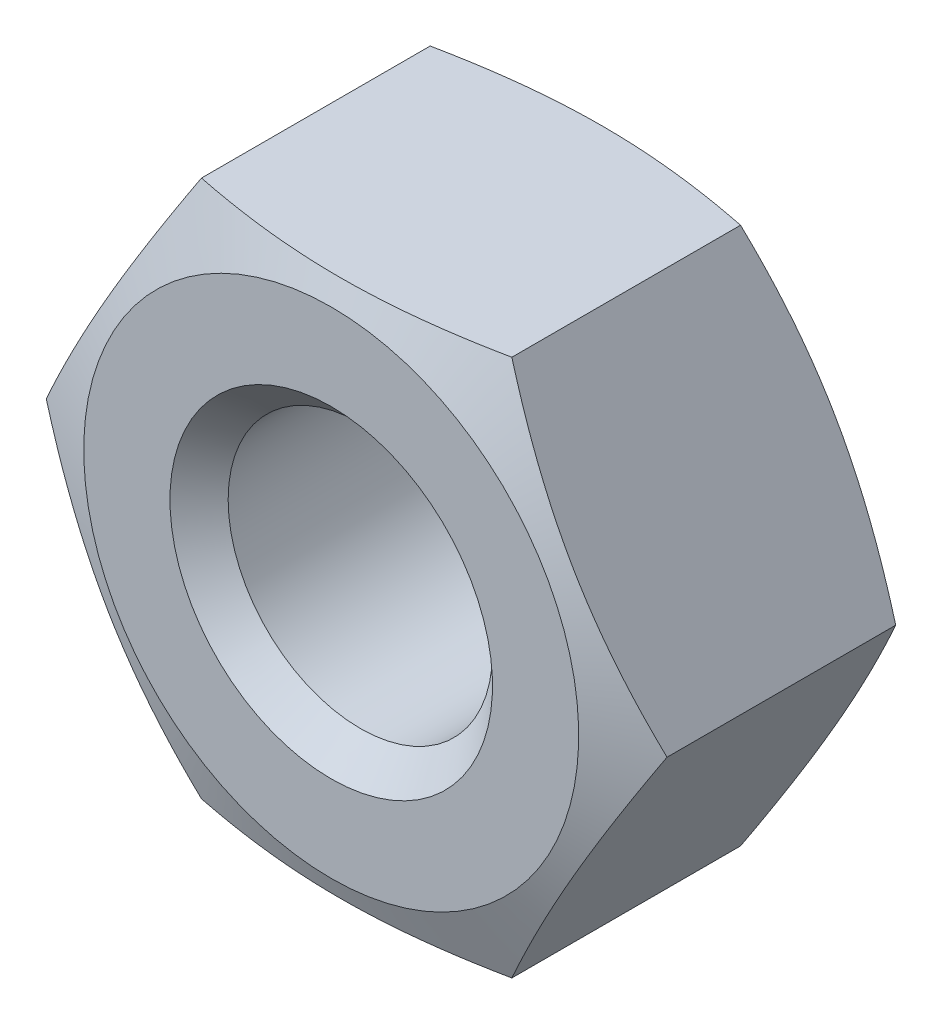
ISO-10303-21;
HEADER;
FILE_DESCRIPTION(('STEP AP214'),'2;1');
FILE_NAME('part.step','',(''),(''),'','','');
FILE_SCHEMA(('AUTOMOTIVE_DESIGN { 1 0 10303 214 1 1 1 1 }'));
ENDSEC;
DATA;
#1=APPLICATION_CONTEXT('core data for automotive mechanical design processes');
#2=APPLICATION_PROTOCOL_DEFINITION('international standard','automotive_design',2000,#1);
#3=PRODUCT_CONTEXT('',#1,'mechanical');
#4=PRODUCT('Part','Part','',(#3));
#5=PRODUCT_RELATED_PRODUCT_CATEGORY('part','',(#4));
#6=PRODUCT_DEFINITION_FORMATION('','',#4);
#7=PRODUCT_DEFINITION_CONTEXT('part definition',#1,'design');
#8=PRODUCT_DEFINITION('design','',#6,#7);
#9=PRODUCT_DEFINITION_SHAPE('','',#8);
#10=(LENGTH_UNIT() NAMED_UNIT(*) SI_UNIT(.MILLI.,.METRE.));
#11=(NAMED_UNIT(*) PLANE_ANGLE_UNIT() SI_UNIT($,.RADIAN.));
#12=(NAMED_UNIT(*) SI_UNIT($,.STERADIAN.) SOLID_ANGLE_UNIT());
#13=UNCERTAINTY_MEASURE_WITH_UNIT(LENGTH_MEASURE(1.E-05),#10,'distance_accuracy_value','');
#14=(GEOMETRIC_REPRESENTATION_CONTEXT(3) GLOBAL_UNCERTAINTY_ASSIGNED_CONTEXT((#13)) GLOBAL_UNIT_ASSIGNED_CONTEXT((#10,
#11,#12)) REPRESENTATION_CONTEXT('',''));
#15=CARTESIAN_POINT('',(0.,0.,0.));
#16=DIRECTION('',(0.,0.,1.));
#17=DIRECTION('',(1.,0.,0.));
#18=AXIS2_PLACEMENT_3D('',#15,#16,#17);
#19=CARTESIAN_POINT('',(5.7735,0.,5.2));
#20=DIRECTION('',(0.,0.,1.));
#21=DIRECTION('',(1.,0.,0.));
#22=AXIS2_PLACEMENT_3D('',#19,#20,#21);
#23=PLANE('',#22);
#24=CARTESIAN_POINT('',(0.,0.,5.2));
#25=DIRECTION('',(0.,0.,-1.));
#26=DIRECTION('',(0.,1.,0.));
#27=AXIS2_PLACEMENT_3D('',#24,#25,#26);
#28=CIRCLE('',#27,3.);
#29=CARTESIAN_POINT('',(0.,3.,5.2));
#30=VERTEX_POINT('',#29);
#31=EDGE_CURVE('E208',#30,#30,#28,.T.);
#32=ORIENTED_EDGE('',*,*,#31,.T.);
#33=EDGE_LOOP('',(#32));
#34=FACE_BOUND('',#33,.T.);
#35=CARTESIAN_POINT('',(0.,0.,5.2));
#36=DIRECTION('',(0.,0.,-1.));
#37=DIRECTION('',(0.,1.,0.));
#38=AXIS2_PLACEMENT_3D('',#35,#36,#37);
#39=CIRCLE('',#38,4.60345894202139);
#40=CARTESIAN_POINT('',(0.,4.60345894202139,5.2));
#41=VERTEX_POINT('',#40);
#42=EDGE_CURVE('E211',#41,#41,#39,.T.);
#43=ORIENTED_EDGE('',*,*,#42,.F.);
#44=EDGE_LOOP('',(#43));
#45=FACE_BOUND('',#44,.T.);
#46=ADVANCED_FACE('F17',(#34,#45),#23,.T.);
#47=CARTESIAN_POINT('',(0.,0.,5.2));
#48=DIRECTION('',(0.,0.,1.));
#49=DIRECTION('',(0.,-1.,0.));
#50=AXIS2_PLACEMENT_3D('',#47,#48,#49);
#51=CONICAL_SURFACE('',#50,3.,0.785398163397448);
#52=CARTESIAN_POINT('',(0.,0.,4.65875));
#53=DIRECTION('',(0.,0.,-1.));
#54=DIRECTION('',(0.,1.,0.));
#55=AXIS2_PLACEMENT_3D('',#52,#53,#54);
#56=CIRCLE('',#55,2.45875);
#57=CARTESIAN_POINT('',(0.,2.45875,4.65875));
#58=VERTEX_POINT('',#57);
#59=EDGE_CURVE('E98',#58,#58,#56,.T.);
#60=ORIENTED_EDGE('',*,*,#59,.T.);
#61=EDGE_LOOP('',(#60));
#62=FACE_BOUND('',#61,.T.);
#63=ORIENTED_EDGE('',*,*,#31,.F.);
#64=EDGE_LOOP('',(#63));
#65=FACE_BOUND('',#64,.T.);
#66=ADVANCED_FACE('F141',(#62,#65),#51,.F.);
#67=CARTESIAN_POINT('',(0.,0.,0.));
#68=DIRECTION('',(0.,0.,-1.));
#69=DIRECTION('',(0.,1.,0.));
#70=AXIS2_PLACEMENT_3D('',#67,#68,#69);
#71=CYLINDRICAL_SURFACE('',#70,2.45875);
#72=CARTESIAN_POINT('',(0.,0.,0.54125));
#73=DIRECTION('',(0.,0.,-1.));
#74=DIRECTION('',(0.,1.,0.));
#75=AXIS2_PLACEMENT_3D('',#72,#73,#74);
#76=CIRCLE('',#75,2.45875);
#77=CARTESIAN_POINT('',(0.,2.45875,0.54125));
#78=VERTEX_POINT('',#77);
#79=EDGE_CURVE('E95',#78,#78,#76,.T.);
#80=ORIENTED_EDGE('',*,*,#79,.T.);
#81=EDGE_LOOP('',(#80));
#82=FACE_BOUND('',#81,.T.);
#83=ORIENTED_EDGE('',*,*,#59,.F.);
#84=EDGE_LOOP('',(#83));
#85=FACE_BOUND('',#84,.T.);
#86=ADVANCED_FACE('F203',(#82,#85),#71,.F.);
#87=CARTESIAN_POINT('',(0.,0.,0.));
#88=DIRECTION('',(0.,0.,-1.));
#89=DIRECTION('',(0.,1.,0.));
#90=AXIS2_PLACEMENT_3D('',#87,#88,#89);
#91=CONICAL_SURFACE('',#90,3.,0.785398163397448);
#92=ORIENTED_EDGE('',*,*,#79,.F.);
#93=EDGE_LOOP('',(#92));
#94=FACE_BOUND('',#93,.T.);
#95=CARTESIAN_POINT('',(0.,0.,0.));
#96=DIRECTION('',(0.,0.,-1.));
#97=DIRECTION('',(0.,1.,0.));
#98=AXIS2_PLACEMENT_3D('',#95,#96,#97);
#99=CIRCLE('',#98,3.);
#100=CARTESIAN_POINT('',(0.,3.,0.));
#101=VERTEX_POINT('',#100);
#102=EDGE_CURVE('E212',#101,#101,#99,.T.);
#103=ORIENTED_EDGE('',*,*,#102,.T.);
#104=EDGE_LOOP('',(#103));
#105=FACE_BOUND('',#104,.T.);
#106=ADVANCED_FACE('F139',(#94,#105),#91,.F.);
#107=CARTESIAN_POINT('',(0.,0.,4.72727272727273));
#108=DIRECTION('',(0.,0.,-1.));
#109=DIRECTION('',(0.,1.,0.));
#110=AXIS2_PLACEMENT_3D('',#107,#108,#109);
#111=CONICAL_SURFACE('',#110,5.7735,1.18682389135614);
#112=ORIENTED_EDGE('',*,*,#42,.T.);
#113=EDGE_LOOP('',(#112));
#114=FACE_BOUND('',#113,.T.);
#115=CARTESIAN_POINT('',(-7.6305290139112,-4.99999766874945,3.37407942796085));
#116=CARTESIAN_POINT('',(-7.40500368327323,-4.99999766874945,3.45027134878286));
#117=CARTESIAN_POINT('',(-7.17917829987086,-4.99999766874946,3.52559150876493));
#118=CARTESIAN_POINT('',(-6.72677217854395,-4.99999766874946,3.67400123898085));
#119=CARTESIAN_POINT('',(-6.5001913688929,-4.99999766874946,3.74709059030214));
#120=CARTESIAN_POINT('',(-6.0456147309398,-4.99999766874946,3.89070982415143));
#121=CARTESIAN_POINT('',(-5.81761680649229,-4.99999766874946,3.96123309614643));
#122=CARTESIAN_POINT('',(-5.36059119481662,-4.99999766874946,4.09885303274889));
#123=CARTESIAN_POINT('',(-5.13156353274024,-4.99999766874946,4.1659497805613));
#124=CARTESIAN_POINT('',(-4.67524705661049,-4.99999766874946,4.29501729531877));
#125=CARTESIAN_POINT('',(-4.44797384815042,-4.99999766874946,4.35704296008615));
#126=CARTESIAN_POINT('',(-3.99204491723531,-4.99999766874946,4.47585390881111));
#127=CARTESIAN_POINT('',(-3.76338915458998,-4.99999766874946,4.53263903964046));
#128=CARTESIAN_POINT('',(-3.30466231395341,-4.99999766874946,4.63961180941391));
#129=CARTESIAN_POINT('',(-3.07459210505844,-4.99999766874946,4.68980314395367));
#130=CARTESIAN_POINT('',(-2.61281649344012,-4.99999766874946,4.7820362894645));
#131=CARTESIAN_POINT('',(-2.38111120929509,-4.99999766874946,4.824078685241));
#132=CARTESIAN_POINT('',(-1.96365477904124,-4.99999766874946,4.89066758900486));
#133=CARTESIAN_POINT('',(-1.77819537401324,-4.99999766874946,4.9170337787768));
#134=CARTESIAN_POINT('',(-1.4064039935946,-4.99999766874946,4.96261357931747));
#135=CARTESIAN_POINT('',(-1.22007209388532,-4.99999766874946,4.98182779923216));
#136=CARTESIAN_POINT('',(-0.846869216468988,-4.99999766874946,5.01234570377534));
#137=CARTESIAN_POINT('',(-0.659998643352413,-4.99999766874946,5.02365427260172));
#138=CARTESIAN_POINT('',(-0.285935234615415,-4.99999766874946,5.03788593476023));
#139=CARTESIAN_POINT('',(-0.098742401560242,-4.99999766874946,5.04080909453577));
#140=CARTESIAN_POINT('',(0.276486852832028,-4.99999766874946,5.03812866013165));
#141=CARTESIAN_POINT('',(0.464522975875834,-4.99999766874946,5.03248376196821));
#142=CARTESIAN_POINT('',(0.840155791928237,-4.99999766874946,5.01285082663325));
#143=CARTESIAN_POINT('',(1.02775247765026,-4.99999766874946,4.99886265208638));
#144=CARTESIAN_POINT('',(1.40231709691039,-4.99999766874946,4.96313063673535));
#145=CARTESIAN_POINT('',(1.58928455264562,-4.99999766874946,4.94138185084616));
#146=CARTESIAN_POINT('',(1.96226966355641,-4.99999766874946,4.89094906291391));
#147=CARTESIAN_POINT('',(2.14828732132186,-4.99999766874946,4.86226507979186));
#148=CARTESIAN_POINT('',(2.55026929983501,-4.99999766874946,4.79357418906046));
#149=CARTESIAN_POINT('',(2.76604596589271,-4.99999766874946,4.75247627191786));
#150=CARTESIAN_POINT('',(3.19619531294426,-4.99999766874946,4.66347736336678));
#151=CARTESIAN_POINT('',(3.41056786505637,-4.99999766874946,4.61557575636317));
#152=CARTESIAN_POINT('',(3.83809761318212,-4.99999766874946,4.51420037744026));
#153=CARTESIAN_POINT('',(4.05125413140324,-4.99999766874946,4.46072376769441));
#154=CARTESIAN_POINT('',(4.47637277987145,-4.99999766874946,4.34927437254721));
#155=CARTESIAN_POINT('',(4.68833495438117,-4.99999766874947,4.29130175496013));
#156=CARTESIAN_POINT('',(5.11177989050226,-4.99999766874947,4.17155908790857));
#157=CARTESIAN_POINT('',(5.32325993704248,-4.99999766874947,4.10977947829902));
#158=CARTESIAN_POINT('',(5.74532805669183,-4.99999766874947,3.98324285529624));
#159=CARTESIAN_POINT('',(5.95591611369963,-4.99999766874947,3.91848578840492));
#160=CARTESIAN_POINT('',(6.58642223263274,-4.99999766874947,3.72063546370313));
#161=CARTESIAN_POINT('',(7.00520498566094,-4.99999766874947,3.58392763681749));
#162=CARTESIAN_POINT('',(7.83776768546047,-4.99999766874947,3.30492566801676));
#163=CARTESIAN_POINT('',(8.25156235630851,-4.99999766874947,3.1626750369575));
#164=CARTESIAN_POINT('',(9.07758724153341,-4.99999766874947,2.87361384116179));
#165=CARTESIAN_POINT('',(9.48981733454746,-4.99999766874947,2.72680293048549));
#166=CARTESIAN_POINT('',(10.3103607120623,-4.99999766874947,2.43087050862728));
#167=CARTESIAN_POINT('',(10.7186818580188,-4.99999766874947,2.28177073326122));
#168=CARTESIAN_POINT('',(11.330465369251,-4.99999766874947,2.05631010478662));
#169=CARTESIAN_POINT('',(11.5342640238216,-4.99999766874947,1.98085954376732));
#170=CARTESIAN_POINT('',(11.9416625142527,-4.99999766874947,1.82942572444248));
#171=CARTESIAN_POINT('',(12.1452623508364,-4.99999766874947,1.75344246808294));
#172=CARTESIAN_POINT('',(12.3487761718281,-4.99999766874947,1.67722956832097));
#173=B_SPLINE_CURVE_WITH_KNOTS('',3,(#115,#116,#117,#118,#119,#120,#121,#122,#123,#124,#125,
#126,#127,#128,#129,#130,#131,#132,#133,#134,#135,#136,#137,#138,#139,#140,#141,#142,#143,#144,
#145,#146,#147,#148,#149,#150,#151,#152,#153,#154,#155,#156,#157,#158,#159,#160,#161,#162,#163,
#164,#165,#166,#167,#168,#169,#170,#171,#172),.UNSPECIFIED.,.F.,.F.,(4,2,2,2,2,2,2,2,2,2,2,2,2,
2,2,2,2,2,2,2,2,2,2,2,2,2,2,2,4),(0.,0.714150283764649,1.4283704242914,2.14431617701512,
2.86024453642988,3.56695043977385,4.27367698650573,4.98000573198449,5.68628376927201,
6.24813678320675,6.80994193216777,7.37139968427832,7.93285298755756,8.49702149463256,
9.06119929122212,9.6257372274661,10.1902736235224,10.8491033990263,11.507992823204,
12.1672192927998,12.8264211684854,13.4873518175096,14.1482943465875,15.4697962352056,
16.7824537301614,18.0952110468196,19.399276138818,20.0512265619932,20.7031746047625),.UNSPECIFIED.);
#174=CARTESIAN_POINT('',(-2.88675,-4.99999766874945,4.72727272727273));
#175=VERTEX_POINT('',#174);
#176=CARTESIAN_POINT('',(2.88675,-4.99999766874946,4.72727272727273));
#177=VERTEX_POINT('',#176);
#178=EDGE_CURVE('E78',#175,#177,#173,.T.);
#179=ORIENTED_EDGE('',*,*,#178,.T.);
#180=CARTESIAN_POINT('',(2.88674988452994,-4.99999786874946,4.7272726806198));
#181=CARTESIAN_POINT('',(2.98760513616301,-4.82531144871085,4.76802319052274));
#182=CARTESIAN_POINT('',(3.08879327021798,-4.65004845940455,4.80570359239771));
#183=CARTESIAN_POINT('',(3.29183863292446,-4.29836357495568,4.87376606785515));
#184=CARTESIAN_POINT('',(3.39369621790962,-4.12194106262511,4.90414386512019));
#185=CARTESIAN_POINT('',(3.59793549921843,-3.76818825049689,4.95638488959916));
#186=CARTESIAN_POINT('',(3.70031703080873,-3.59085823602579,4.97825064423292));
#187=CARTESIAN_POINT('',(3.90546039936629,-3.23553949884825,5.0124542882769));
#188=CARTESIAN_POINT('',(4.00822214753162,-3.05755092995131,5.02479427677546));
#189=CARTESIAN_POINT('',(4.21218124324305,-2.70428341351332,5.03917901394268));
#190=CARTESIAN_POINT('',(4.31337552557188,-2.52900977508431,5.04139502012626));
#191=CARTESIAN_POINT('',(4.51570428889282,-2.17856607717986,5.03587831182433));
#192=CARTESIAN_POINT('',(4.61683876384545,-2.00339602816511,5.02814472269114));
#193=CARTESIAN_POINT('',(4.81874245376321,-1.65368857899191,5.00314456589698));
#194=CARTESIAN_POINT('',(4.91951185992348,-1.47915084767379,4.98588405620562));
#195=CARTESIAN_POINT('',(5.12056954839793,-1.13090871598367,4.94266654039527));
#196=CARTESIAN_POINT('',(5.220857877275,-0.957204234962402,4.91671039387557));
#197=CARTESIAN_POINT('',(5.35868198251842,-0.718485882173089,4.8756812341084));
#198=CARTESIAN_POINT('',(5.39646887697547,-0.65303706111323,4.86387437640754));
#199=CARTESIAN_POINT('',(5.47195348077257,-0.522293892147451,4.83923251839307));
#200=CARTESIAN_POINT('',(5.50965120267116,-0.456999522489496,4.82639767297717));
#201=CARTESIAN_POINT('',(5.58508963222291,-0.326336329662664,4.79971352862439));
#202=CARTESIAN_POINT('',(5.62283004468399,-0.260968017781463,4.78586090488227));
#203=CARTESIAN_POINT('',(5.69822818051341,-0.130374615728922,4.75723897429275));
#204=CARTESIAN_POINT('',(5.73588589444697,-0.0651495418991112,4.74246956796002));
#205=CARTESIAN_POINT('',(5.77350011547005,1.99999999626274E-07,4.7272726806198));
#206=B_SPLINE_CURVE_WITH_KNOTS('',3,(#180,#181,#182,#183,#184,#185,#186,#187,#188,#189,#190,
#191,#192,#193,#194,#195,#196,#197,#198,#199,#200,#201,#202,#203,#204,#205),.UNSPECIFIED.,.F.,
.F.,(4,2,2,2,2,2,2,2,2,2,2,2,4),(0.,0.617400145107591,1.23516095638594,1.85273820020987,
2.47017931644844,3.07713614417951,3.68414633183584,4.290770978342,4.89733567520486,
5.12680289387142,5.35623560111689,5.5864543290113,5.81669808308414),.UNSPECIFIED.);
#207=CARTESIAN_POINT('',(5.7735,0.,4.72727272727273));
#208=VERTEX_POINT('',#207);
#209=EDGE_CURVE('E163',#177,#208,#206,.T.);
#210=ORIENTED_EDGE('',*,*,#209,.T.);
#211=CARTESIAN_POINT('',(5.77350011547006,-2.00000000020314E-07,4.7272726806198));
#212=CARTESIAN_POINT('',(5.67264486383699,0.174686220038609,4.76802319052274));
#213=CARTESIAN_POINT('',(5.57145672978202,0.349949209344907,4.80570359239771));
#214=CARTESIAN_POINT('',(5.36841136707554,0.701634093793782,4.87376606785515));
#215=CARTESIAN_POINT('',(5.26655378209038,0.87805660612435,4.90414386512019));
#216=CARTESIAN_POINT('',(5.06231450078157,1.23180941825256,4.95638488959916));
#217=CARTESIAN_POINT('',(4.95993296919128,1.40913943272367,4.97825064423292));
#218=CARTESIAN_POINT('',(4.75478960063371,1.7644581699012,5.01245428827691));
#219=CARTESIAN_POINT('',(4.65202785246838,1.94244673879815,5.02479427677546));
#220=CARTESIAN_POINT('',(4.44806875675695,2.29571425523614,5.03917901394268));
#221=CARTESIAN_POINT('',(4.34687447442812,2.47098789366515,5.04139502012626));
#222=CARTESIAN_POINT('',(4.14454571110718,2.8214315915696,5.03587831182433));
#223=CARTESIAN_POINT('',(4.04341123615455,2.99660164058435,5.02814472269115));
#224=CARTESIAN_POINT('',(3.84150754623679,3.34630908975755,5.00314456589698));
#225=CARTESIAN_POINT('',(3.74073814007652,3.52084682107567,4.98588405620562));
#226=CARTESIAN_POINT('',(3.53968045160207,3.86908895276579,4.94266654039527));
#227=CARTESIAN_POINT('',(3.43939212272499,4.04279343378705,4.91671039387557));
#228=CARTESIAN_POINT('',(3.30156801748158,4.28151178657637,4.8756812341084));
#229=CARTESIAN_POINT('',(3.26378112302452,4.34696060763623,4.86387437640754));
#230=CARTESIAN_POINT('',(3.18829651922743,4.47770377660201,4.83923251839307));
#231=CARTESIAN_POINT('',(3.15059879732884,4.54299814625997,4.82639767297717));
#232=CARTESIAN_POINT('',(3.07516036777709,4.6736613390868,4.79971352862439));
#233=CARTESIAN_POINT('',(3.03741995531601,4.739029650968,4.78586090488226));
#234=CARTESIAN_POINT('',(2.96202181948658,4.86962305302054,4.75723897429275));
#235=CARTESIAN_POINT('',(2.92436410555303,4.93484812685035,4.74246956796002));
#236=CARTESIAN_POINT('',(2.88674988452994,4.99999786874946,4.7272726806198));
#237=B_SPLINE_CURVE_WITH_KNOTS('',3,(#211,#212,#213,#214,#215,#216,#217,#218,#219,#220,#221,
#222,#223,#224,#225,#226,#227,#228,#229,#230,#231,#232,#233,#234,#235,#236),.UNSPECIFIED.,.F.,
.F.,(4,2,2,2,2,2,2,2,2,2,2,2,4),(0.,0.617400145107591,1.23516095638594,1.85273820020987,
2.47017931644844,3.07713614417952,3.68414633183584,4.29077097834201,4.89733567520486,
5.12680289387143,5.35623560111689,5.5864543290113,5.81669808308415),.UNSPECIFIED.);
#238=CARTESIAN_POINT('',(2.88675,4.99999766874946,4.72727272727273));
#239=VERTEX_POINT('',#238);
#240=EDGE_CURVE('E40',#208,#239,#237,.T.);
#241=ORIENTED_EDGE('',*,*,#240,.T.);
#242=CARTESIAN_POINT('',(-7.6305290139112,4.99999766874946,3.37407942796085));
#243=CARTESIAN_POINT('',(-7.40500368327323,4.99999766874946,3.45027134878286));
#244=CARTESIAN_POINT('',(-7.17917829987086,4.99999766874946,3.52559150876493));
#245=CARTESIAN_POINT('',(-6.72677217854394,4.99999766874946,3.67400123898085));
#246=CARTESIAN_POINT('',(-6.5001913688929,4.99999766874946,3.74709059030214));
#247=CARTESIAN_POINT('',(-6.04561473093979,4.99999766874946,3.89070982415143));
#248=CARTESIAN_POINT('',(-5.81761680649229,4.99999766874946,3.96123309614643));
#249=CARTESIAN_POINT('',(-5.36059119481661,4.99999766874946,4.09885303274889));
#250=CARTESIAN_POINT('',(-5.13156353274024,4.99999766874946,4.1659497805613));
#251=CARTESIAN_POINT('',(-4.67524705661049,4.99999766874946,4.29501729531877));
#252=CARTESIAN_POINT('',(-4.44797384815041,4.99999766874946,4.35704296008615));
#253=CARTESIAN_POINT('',(-3.99204491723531,4.99999766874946,4.47585390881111));
#254=CARTESIAN_POINT('',(-3.76338915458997,4.99999766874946,4.53263903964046));
#255=CARTESIAN_POINT('',(-3.3046623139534,4.99999766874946,4.63961180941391));
#256=CARTESIAN_POINT('',(-3.07459210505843,4.99999766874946,4.68980314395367));
#257=CARTESIAN_POINT('',(-2.61281649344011,4.99999766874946,4.7820362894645));
#258=CARTESIAN_POINT('',(-2.38111120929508,4.99999766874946,4.82407868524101));
#259=CARTESIAN_POINT('',(-1.96365477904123,4.99999766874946,4.89066758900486));
#260=CARTESIAN_POINT('',(-1.77819537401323,4.99999766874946,4.9170337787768));
#261=CARTESIAN_POINT('',(-1.40640399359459,4.99999766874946,4.96261357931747));
#262=CARTESIAN_POINT('',(-1.22007209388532,4.99999766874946,4.98182779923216));
#263=CARTESIAN_POINT('',(-0.846869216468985,4.99999766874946,5.01234570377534));
#264=CARTESIAN_POINT('',(-0.659998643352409,4.99999766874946,5.02365427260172));
#265=CARTESIAN_POINT('',(-0.285935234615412,4.99999766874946,5.03788593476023));
#266=CARTESIAN_POINT('',(-0.098742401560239,4.99999766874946,5.04080909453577));
#267=CARTESIAN_POINT('',(0.276486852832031,4.99999766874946,5.03812866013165));
#268=CARTESIAN_POINT('',(0.464522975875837,4.99999766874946,5.03248376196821));
#269=CARTESIAN_POINT('',(0.840155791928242,4.99999766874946,5.01285082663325));
#270=CARTESIAN_POINT('',(1.02775247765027,4.99999766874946,4.99886265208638));
#271=CARTESIAN_POINT('',(1.4023170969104,4.99999766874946,4.96313063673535));
#272=CARTESIAN_POINT('',(1.58928455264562,4.99999766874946,4.94138185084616));
#273=CARTESIAN_POINT('',(1.96226966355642,4.99999766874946,4.89094906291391));
#274=CARTESIAN_POINT('',(2.14828732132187,4.99999766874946,4.86226507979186));
#275=CARTESIAN_POINT('',(2.55026929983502,4.99999766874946,4.79357418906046));
#276=CARTESIAN_POINT('',(2.76604596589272,4.99999766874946,4.75247627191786));
#277=CARTESIAN_POINT('',(3.19619531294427,4.99999766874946,4.66347736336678));
#278=CARTESIAN_POINT('',(3.41056786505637,4.99999766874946,4.61557575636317));
#279=CARTESIAN_POINT('',(3.83809761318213,4.99999766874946,4.51420037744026));
#280=CARTESIAN_POINT('',(4.05125413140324,4.99999766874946,4.46072376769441));
#281=CARTESIAN_POINT('',(4.47637277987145,4.99999766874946,4.34927437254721));
#282=CARTESIAN_POINT('',(4.68833495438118,4.99999766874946,4.29130175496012));
#283=CARTESIAN_POINT('',(5.11177989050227,4.99999766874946,4.17155908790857));
#284=CARTESIAN_POINT('',(5.32325993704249,4.99999766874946,4.10977947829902));
#285=CARTESIAN_POINT('',(5.74532805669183,4.99999766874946,3.98324285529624));
#286=CARTESIAN_POINT('',(5.95591611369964,4.99999766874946,3.91848578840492));
#287=CARTESIAN_POINT('',(6.58642223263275,4.99999766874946,3.72063546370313));
#288=CARTESIAN_POINT('',(7.00520498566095,4.99999766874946,3.58392763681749));
#289=CARTESIAN_POINT('',(7.83776768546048,4.99999766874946,3.30492566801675));
#290=CARTESIAN_POINT('',(8.25156235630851,4.99999766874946,3.1626750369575));
#291=CARTESIAN_POINT('',(9.07758724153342,4.99999766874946,2.87361384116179));
#292=CARTESIAN_POINT('',(9.48981733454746,4.99999766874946,2.72680293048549));
#293=CARTESIAN_POINT('',(10.3103607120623,4.99999766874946,2.43087050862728));
#294=CARTESIAN_POINT('',(10.7186818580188,4.99999766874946,2.28177073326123));
#295=CARTESIAN_POINT('',(11.330465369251,4.99999766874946,2.05631010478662));
#296=CARTESIAN_POINT('',(11.5342640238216,4.99999766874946,1.98085954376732));
#297=CARTESIAN_POINT('',(11.9416625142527,4.99999766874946,1.82942572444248));
#298=CARTESIAN_POINT('',(12.1452623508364,4.99999766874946,1.75344246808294));
#299=CARTESIAN_POINT('',(12.3487761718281,4.99999766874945,1.67722956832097));
#300=B_SPLINE_CURVE_WITH_KNOTS('',3,(#242,#243,#244,#245,#246,#247,#248,#249,#250,#251,#252,
#253,#254,#255,#256,#257,#258,#259,#260,#261,#262,#263,#264,#265,#266,#267,#268,#269,#270,#271,
#272,#273,#274,#275,#276,#277,#278,#279,#280,#281,#282,#283,#284,#285,#286,#287,#288,#289,#290,
#291,#292,#293,#294,#295,#296,#297,#298,#299),.UNSPECIFIED.,.F.,.F.,(4,2,2,2,2,2,2,2,2,2,2,2,2,
2,2,2,2,2,2,2,2,2,2,2,2,2,2,2,4),(0.,0.714150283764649,1.4283704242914,2.14431617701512,
2.86024453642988,3.56695043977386,4.27367698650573,4.9800057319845,5.68628376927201,
6.24813678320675,6.80994193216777,7.37139968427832,7.93285298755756,8.49702149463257,
9.06119929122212,9.62573722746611,10.1902736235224,10.8491033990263,11.507992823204,
12.1672192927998,12.8264211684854,13.4873518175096,14.1482943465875,15.4697962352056,
16.7824537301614,18.0952110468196,19.399276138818,20.0512265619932,20.7031746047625),.UNSPECIFIED.);
#301=CARTESIAN_POINT('',(-2.88675,4.99999766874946,4.72727272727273));
#302=VERTEX_POINT('',#301);
#303=EDGE_CURVE('E154',#239,#302,#300,.F.);
#304=ORIENTED_EDGE('',*,*,#303,.T.);
#305=CARTESIAN_POINT('',(-2.88674988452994,4.99999786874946,4.7272726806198));
#306=CARTESIAN_POINT('',(-2.98760513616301,4.82531144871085,4.76802319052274));
#307=CARTESIAN_POINT('',(-3.08879327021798,4.65004845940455,4.80570359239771));
#308=CARTESIAN_POINT('',(-3.29183863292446,4.29836357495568,4.87376606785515));
#309=CARTESIAN_POINT('',(-3.39369621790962,4.12194106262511,4.90414386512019));
#310=CARTESIAN_POINT('',(-3.59793549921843,3.7681882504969,4.95638488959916));
#311=CARTESIAN_POINT('',(-3.70031703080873,3.59085823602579,4.97825064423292));
#312=CARTESIAN_POINT('',(-3.9054603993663,3.23553949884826,5.0124542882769));
#313=CARTESIAN_POINT('',(-4.00822214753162,3.05755092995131,5.02479427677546));
#314=CARTESIAN_POINT('',(-4.21218124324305,2.70428341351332,5.03917901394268));
#315=CARTESIAN_POINT('',(-4.31337552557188,2.52900977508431,5.04139502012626));
#316=CARTESIAN_POINT('',(-4.51570428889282,2.17856607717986,5.03587831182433));
#317=CARTESIAN_POINT('',(-4.61683876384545,2.00339602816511,5.02814472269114));
#318=CARTESIAN_POINT('',(-4.81874245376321,1.65368857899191,5.00314456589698));
#319=CARTESIAN_POINT('',(-4.91951185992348,1.47915084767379,4.98588405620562));
#320=CARTESIAN_POINT('',(-5.12056954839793,1.13090871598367,4.94266654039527));
#321=CARTESIAN_POINT('',(-5.220857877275,0.957204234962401,4.91671039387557));
#322=CARTESIAN_POINT('',(-5.35868198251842,0.718485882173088,4.8756812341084));
#323=CARTESIAN_POINT('',(-5.39646887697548,0.653037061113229,4.86387437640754));
#324=CARTESIAN_POINT('',(-5.47195348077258,0.52229389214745,4.83923251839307));
#325=CARTESIAN_POINT('',(-5.50965120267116,0.456999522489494,4.82639767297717));
#326=CARTESIAN_POINT('',(-5.58508963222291,0.326336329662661,4.79971352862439));
#327=CARTESIAN_POINT('',(-5.62283004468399,0.26096801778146,4.78586090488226));
#328=CARTESIAN_POINT('',(-5.69822818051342,0.130374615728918,4.75723897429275));
#329=CARTESIAN_POINT('',(-5.73588589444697,0.0651495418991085,4.74246956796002));
#330=CARTESIAN_POINT('',(-5.77350011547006,-1.99999999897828E-07,4.7272726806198));
#331=B_SPLINE_CURVE_WITH_KNOTS('',3,(#305,#306,#307,#308,#309,#310,#311,#312,#313,#314,#315,
#316,#317,#318,#319,#320,#321,#322,#323,#324,#325,#326,#327,#328,#329,#330),.UNSPECIFIED.,.F.,
.F.,(4,2,2,2,2,2,2,2,2,2,2,2,4),(0.,0.617400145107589,1.23516095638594,1.85273820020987,
2.47017931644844,3.07713614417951,3.68414633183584,4.290770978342,4.89733567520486,
5.12680289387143,5.35623560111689,5.5864543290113,5.81669808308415),.UNSPECIFIED.);
#332=CARTESIAN_POINT('',(-5.7735,0.,4.72727272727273));
#333=VERTEX_POINT('',#332);
#334=EDGE_CURVE('E149',#302,#333,#331,.T.);
#335=ORIENTED_EDGE('',*,*,#334,.T.);
#336=CARTESIAN_POINT('',(-5.77350011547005,1.99999999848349E-07,4.7272726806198));
#337=CARTESIAN_POINT('',(-5.67264486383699,-0.174686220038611,4.76802319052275));
#338=CARTESIAN_POINT('',(-5.57145672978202,-0.349949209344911,4.80570359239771));
#339=CARTESIAN_POINT('',(-5.36841136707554,-0.701634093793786,4.87376606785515));
#340=CARTESIAN_POINT('',(-5.26655378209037,-0.878056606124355,4.90414386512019));
#341=CARTESIAN_POINT('',(-5.06231450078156,-1.23180941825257,4.95638488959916));
#342=CARTESIAN_POINT('',(-4.95993296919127,-1.40913943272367,4.97825064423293));
#343=CARTESIAN_POINT('',(-4.7547896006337,-1.76445816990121,5.01245428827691));
#344=CARTESIAN_POINT('',(-4.65202785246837,-1.94244673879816,5.02479427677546));
#345=CARTESIAN_POINT('',(-4.44806875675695,-2.29571425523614,5.03917901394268));
#346=CARTESIAN_POINT('',(-4.34687447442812,-2.47098789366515,5.04139502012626));
#347=CARTESIAN_POINT('',(-4.14454571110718,-2.8214315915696,5.03587831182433));
#348=CARTESIAN_POINT('',(-4.04341123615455,-2.99660164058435,5.02814472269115));
#349=CARTESIAN_POINT('',(-3.84150754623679,-3.34630908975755,5.00314456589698));
#350=CARTESIAN_POINT('',(-3.74073814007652,-3.52084682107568,4.98588405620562));
#351=CARTESIAN_POINT('',(-3.53968045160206,-3.86908895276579,4.94266654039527));
#352=CARTESIAN_POINT('',(-3.43939212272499,-4.04279343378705,4.91671039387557));
#353=CARTESIAN_POINT('',(-3.30156801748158,-4.28151178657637,4.8756812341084));
#354=CARTESIAN_POINT('',(-3.26378112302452,-4.34696060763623,4.86387437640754));
#355=CARTESIAN_POINT('',(-3.18829651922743,-4.47770377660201,4.83923251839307));
#356=CARTESIAN_POINT('',(-3.15059879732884,-4.54299814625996,4.82639767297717));
#357=CARTESIAN_POINT('',(-3.07516036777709,-4.67366133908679,4.79971352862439));
#358=CARTESIAN_POINT('',(-3.03741995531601,-4.73902965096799,4.78586090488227));
#359=CARTESIAN_POINT('',(-2.96202181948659,-4.86962305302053,4.75723897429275));
#360=CARTESIAN_POINT('',(-2.92436410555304,-4.93484812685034,4.74246956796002));
#361=CARTESIAN_POINT('',(-2.88674988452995,-4.99999786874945,4.7272726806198));
#362=B_SPLINE_CURVE_WITH_KNOTS('',3,(#336,#337,#338,#339,#340,#341,#342,#343,#344,#345,#346,
#347,#348,#349,#350,#351,#352,#353,#354,#355,#356,#357,#358,#359,#360,#361),.UNSPECIFIED.,.F.,
.F.,(4,2,2,2,2,2,2,2,2,2,2,2,4),(0.,0.61740014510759,1.23516095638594,1.85273820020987,
2.47017931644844,3.07713614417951,3.68414633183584,4.290770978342,4.89733567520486,
5.12680289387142,5.35623560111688,5.58645432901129,5.81669808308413),.UNSPECIFIED.);
#363=EDGE_CURVE('E126',#333,#175,#362,.T.);
#364=ORIENTED_EDGE('',*,*,#363,.T.);
#365=EDGE_LOOP('',(#179,#210,#241,#304,#335,#364));
#366=FACE_BOUND('',#365,.T.);
#367=ADVANCED_FACE('F135',(#114,#366),#111,.T.);
#368=CARTESIAN_POINT('',(2.88675,-4.99999766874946,5.2));
#369=DIRECTION('',(-0.866025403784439,0.5,0.));
#370=DIRECTION('',(-0.5,-0.866025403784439,0.));
#371=AXIS2_PLACEMENT_3D('',#368,#369,#370);
#372=PLANE('',#371);
#373=ORIENTED_EDGE('',*,*,#209,.F.);
#374=DIRECTION('',(0.,0.,-1.));
#375=VECTOR('',#374,1.);
#376=CARTESIAN_POINT('',(2.88675,-4.99999766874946,5.2));
#377=LINE('',#376,#375);
#378=CARTESIAN_POINT('',(2.88675,-4.99999766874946,0.472727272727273));
#379=VERTEX_POINT('',#378);
#380=EDGE_CURVE('E82',#177,#379,#377,.T.);
#381=ORIENTED_EDGE('',*,*,#380,.T.);
#382=CARTESIAN_POINT('',(5.77350011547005,2.E-07,0.472727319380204));
#383=CARTESIAN_POINT('',(5.67264486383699,-0.174686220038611,0.431976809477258));
#384=CARTESIAN_POINT('',(5.57145672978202,-0.349949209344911,0.394296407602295));
#385=CARTESIAN_POINT('',(5.36841136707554,-0.701634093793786,0.326233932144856));
#386=CARTESIAN_POINT('',(5.26655378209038,-0.878056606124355,0.295856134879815));
#387=CARTESIAN_POINT('',(5.06231450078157,-1.23180941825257,0.243615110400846));
#388=CARTESIAN_POINT('',(4.95993296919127,-1.40913943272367,0.221749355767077));
#389=CARTESIAN_POINT('',(4.75478960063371,-1.76445816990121,0.187545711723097));
#390=CARTESIAN_POINT('',(4.65202785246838,-1.94244673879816,0.175205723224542));
#391=CARTESIAN_POINT('',(4.44806875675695,-2.29571425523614,0.160820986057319));
#392=CARTESIAN_POINT('',(4.34687447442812,-2.47098789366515,0.158604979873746));
#393=CARTESIAN_POINT('',(4.14454571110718,-2.8214315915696,0.16412168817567));
#394=CARTESIAN_POINT('',(4.04341123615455,-2.99660164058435,0.171855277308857));
#395=CARTESIAN_POINT('',(3.84150754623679,-3.34630908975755,0.19685543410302));
#396=CARTESIAN_POINT('',(3.74073814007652,-3.52084682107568,0.214115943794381));
#397=CARTESIAN_POINT('',(3.53968045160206,-3.86908895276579,0.257333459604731));
#398=CARTESIAN_POINT('',(3.43939212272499,-4.04279343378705,0.283289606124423));
#399=CARTESIAN_POINT('',(3.30156801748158,-4.28151178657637,0.324318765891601));
#400=CARTESIAN_POINT('',(3.26378112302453,-4.34696060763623,0.336125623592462));
#401=CARTESIAN_POINT('',(3.18829651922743,-4.47770377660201,0.360767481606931));
#402=CARTESIAN_POINT('',(3.15059879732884,-4.54299814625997,0.373602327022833));
#403=CARTESIAN_POINT('',(3.07516036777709,-4.6736613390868,0.400286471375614));
#404=CARTESIAN_POINT('',(3.03741995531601,-4.739029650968,0.414139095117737));
#405=CARTESIAN_POINT('',(2.96202181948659,-4.86962305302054,0.442761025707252));
#406=CARTESIAN_POINT('',(2.92436410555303,-4.93484812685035,0.457530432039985));
#407=CARTESIAN_POINT('',(2.88674988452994,-4.99999786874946,0.472727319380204));
#408=B_SPLINE_CURVE_WITH_KNOTS('',3,(#382,#383,#384,#385,#386,#387,#388,#389,#390,#391,#392,
#393,#394,#395,#396,#397,#398,#399,#400,#401,#402,#403,#404,#405,#406,#407),.UNSPECIFIED.,.F.,
.F.,(4,2,2,2,2,2,2,2,2,2,2,2,4),(0.,0.61740014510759,1.23516095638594,1.85273820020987,
2.47017931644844,3.07713614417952,3.68414633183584,4.290770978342,4.89733567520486,
5.12680289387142,5.35623560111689,5.5864543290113,5.81669808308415),.UNSPECIFIED.);
#409=CARTESIAN_POINT('',(5.7735,0.,0.472727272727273));
#410=VERTEX_POINT('',#409);
#411=EDGE_CURVE('E33',#410,#379,#408,.T.);
#412=ORIENTED_EDGE('',*,*,#411,.F.);
#413=DIRECTION('',(0.,0.,-1.));
#414=VECTOR('',#413,1.);
#415=CARTESIAN_POINT('',(5.7735,0.,5.2));
#416=LINE('',#415,#414);
#417=EDGE_CURVE('E26',#208,#410,#416,.T.);
#418=ORIENTED_EDGE('',*,*,#417,.F.);
#419=EDGE_LOOP('',(#373,#381,#412,#418));
#420=FACE_BOUND('',#419,.T.);
#421=ADVANCED_FACE('F19',(#420),#372,.F.);
#422=CARTESIAN_POINT('',(5.7735,0.,5.2));
#423=DIRECTION('',(-0.866025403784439,-0.5,0.));
#424=DIRECTION('',(0.5,-0.866025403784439,0.));
#425=AXIS2_PLACEMENT_3D('',#422,#423,#424);
#426=PLANE('',#425);
#427=ORIENTED_EDGE('',*,*,#240,.F.);
#428=ORIENTED_EDGE('',*,*,#417,.T.);
#429=CARTESIAN_POINT('',(2.88674988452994,4.99999786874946,0.472727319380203));
#430=CARTESIAN_POINT('',(2.98760513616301,4.82531144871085,0.431976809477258));
#431=CARTESIAN_POINT('',(3.08879327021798,4.65004845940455,0.394296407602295));
#432=CARTESIAN_POINT('',(3.29183863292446,4.29836357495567,0.326233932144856));
#433=CARTESIAN_POINT('',(3.39369621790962,4.12194106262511,0.295856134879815));
#434=CARTESIAN_POINT('',(3.59793549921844,3.76818825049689,0.243615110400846));
#435=CARTESIAN_POINT('',(3.70031703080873,3.59085823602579,0.221749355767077));
#436=CARTESIAN_POINT('',(3.9054603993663,3.23553949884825,0.187545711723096));
#437=CARTESIAN_POINT('',(4.00822214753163,3.0575509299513,0.175205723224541));
#438=CARTESIAN_POINT('',(4.21218124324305,2.70428341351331,0.160820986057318));
#439=CARTESIAN_POINT('',(4.31337552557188,2.52900977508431,0.158604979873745));
#440=CARTESIAN_POINT('',(4.51570428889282,2.17856607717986,0.16412168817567));
#441=CARTESIAN_POINT('',(4.61683876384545,2.00339602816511,0.171855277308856));
#442=CARTESIAN_POINT('',(4.81874245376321,1.65368857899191,0.196855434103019));
#443=CARTESIAN_POINT('',(4.91951185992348,1.47915084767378,0.21411594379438));
#444=CARTESIAN_POINT('',(5.12056954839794,1.13090871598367,0.257333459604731));
#445=CARTESIAN_POINT('',(5.22085787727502,0.957204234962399,0.283289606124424));
#446=CARTESIAN_POINT('',(5.35868198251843,0.718485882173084,0.324318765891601));
#447=CARTESIAN_POINT('',(5.39646887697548,0.653037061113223,0.336125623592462));
#448=CARTESIAN_POINT('',(5.47195348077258,0.522293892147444,0.36076748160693));
#449=CARTESIAN_POINT('',(5.50965120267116,0.456999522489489,0.373602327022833));
#450=CARTESIAN_POINT('',(5.58508963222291,0.326336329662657,0.400286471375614));
#451=CARTESIAN_POINT('',(5.62283004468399,0.260968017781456,0.414139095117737));
#452=CARTESIAN_POINT('',(5.69822818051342,0.130374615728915,0.442761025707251));
#453=CARTESIAN_POINT('',(5.73588589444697,0.0651495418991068,0.457530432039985));
#454=CARTESIAN_POINT('',(5.77350011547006,-1.99999999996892E-07,0.472727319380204));
#455=B_SPLINE_CURVE_WITH_KNOTS('',3,(#429,#430,#431,#432,#433,#434,#435,#436,#437,#438,#439,
#440,#441,#442,#443,#444,#445,#446,#447,#448,#449,#450,#451,#452,#453,#454),.UNSPECIFIED.,.F.,
.F.,(4,2,2,2,2,2,2,2,2,2,2,2,4),(0.,0.617400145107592,1.23516095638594,1.85273820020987,
2.47017931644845,3.07713614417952,3.68414633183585,4.29077097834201,4.89733567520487,
5.12680289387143,5.35623560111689,5.58645432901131,5.81669808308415),.UNSPECIFIED.);
#456=CARTESIAN_POINT('',(2.88675,4.99999766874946,0.472727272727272));
#457=VERTEX_POINT('',#456);
#458=EDGE_CURVE('E174',#457,#410,#455,.T.);
#459=ORIENTED_EDGE('',*,*,#458,.F.);
#460=DIRECTION('',(0.,0.,-1.));
#461=VECTOR('',#460,1.);
#462=CARTESIAN_POINT('',(2.88675,4.99999766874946,5.2));
#463=LINE('',#462,#461);
#464=EDGE_CURVE('E416',#239,#457,#463,.T.);
#465=ORIENTED_EDGE('',*,*,#464,.F.);
#466=EDGE_LOOP('',(#427,#428,#459,#465));
#467=FACE_BOUND('',#466,.T.);
#468=ADVANCED_FACE('F168',(#467),#426,.F.);
#469=CARTESIAN_POINT('',(2.88675,4.99999766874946,5.2));
#470=DIRECTION('',(0.,-1.,0.));
#471=DIRECTION('',(1.,0.,0.));
#472=AXIS2_PLACEMENT_3D('',#469,#470,#471);
#473=PLANE('',#472);
#474=ORIENTED_EDGE('',*,*,#303,.F.);
#475=ORIENTED_EDGE('',*,*,#464,.T.);
#476=CARTESIAN_POINT('',(-7.6305290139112,4.99999766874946,1.82592057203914));
#477=CARTESIAN_POINT('',(-7.40500368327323,4.99999766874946,1.74972865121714));
#478=CARTESIAN_POINT('',(-7.17917829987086,4.99999766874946,1.67440849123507));
#479=CARTESIAN_POINT('',(-6.72677217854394,4.99999766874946,1.52599876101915));
#480=CARTESIAN_POINT('',(-6.5001913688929,4.99999766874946,1.45290940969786));
#481=CARTESIAN_POINT('',(-6.0456147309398,4.99999766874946,1.30929017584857));
#482=CARTESIAN_POINT('',(-5.81761680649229,4.99999766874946,1.23876690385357));
#483=CARTESIAN_POINT('',(-5.36059119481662,4.99999766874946,1.10114696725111));
#484=CARTESIAN_POINT('',(-5.13156353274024,4.99999766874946,1.0340502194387));
#485=CARTESIAN_POINT('',(-4.67524705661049,4.99999766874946,0.904982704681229));
#486=CARTESIAN_POINT('',(-4.44797384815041,4.99999766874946,0.842957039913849));
#487=CARTESIAN_POINT('',(-3.99204491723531,4.99999766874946,0.724146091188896));
#488=CARTESIAN_POINT('',(-3.76338915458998,4.99999766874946,0.667360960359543));
#489=CARTESIAN_POINT('',(-3.3046623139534,4.99999766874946,0.560388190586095));
#490=CARTESIAN_POINT('',(-3.07459210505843,4.99999766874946,0.510196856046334));
#491=CARTESIAN_POINT('',(-2.61281649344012,4.99999766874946,0.417963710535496));
#492=CARTESIAN_POINT('',(-2.38111120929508,4.99999766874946,0.375921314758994));
#493=CARTESIAN_POINT('',(-1.96365477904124,4.99999766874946,0.309332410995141));
#494=CARTESIAN_POINT('',(-1.77819537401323,4.99999766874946,0.282966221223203));
#495=CARTESIAN_POINT('',(-1.40640399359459,4.99999766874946,0.237386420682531));
#496=CARTESIAN_POINT('',(-1.22007209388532,4.99999766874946,0.218172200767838));
#497=CARTESIAN_POINT('',(-0.846869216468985,4.99999766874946,0.18765429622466));
#498=CARTESIAN_POINT('',(-0.65999864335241,4.99999766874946,0.176345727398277));
#499=CARTESIAN_POINT('',(-0.285935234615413,4.99999766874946,0.162114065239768));
#500=CARTESIAN_POINT('',(-0.0987424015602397,4.99999766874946,0.159190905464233));
#501=CARTESIAN_POINT('',(0.27648685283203,4.99999766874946,0.161871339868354));
#502=CARTESIAN_POINT('',(0.464522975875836,4.99999766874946,0.167516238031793));
#503=CARTESIAN_POINT('',(0.840155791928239,4.99999766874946,0.187149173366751));
#504=CARTESIAN_POINT('',(1.02775247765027,4.99999766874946,0.201137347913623));
#505=CARTESIAN_POINT('',(1.40231709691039,4.99999766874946,0.23686936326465));
#506=CARTESIAN_POINT('',(1.58928455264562,4.99999766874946,0.258618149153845));
#507=CARTESIAN_POINT('',(1.96226966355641,4.99999766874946,0.309050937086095));
#508=CARTESIAN_POINT('',(2.14828732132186,4.99999766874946,0.337734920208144));
#509=CARTESIAN_POINT('',(2.55026929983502,4.99999766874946,0.406425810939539));
#510=CARTESIAN_POINT('',(2.76604596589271,4.99999766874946,0.447523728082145));
#511=CARTESIAN_POINT('',(3.19619531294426,4.99999766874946,0.536522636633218));
#512=CARTESIAN_POINT('',(3.41056786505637,4.99999766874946,0.584424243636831));
#513=CARTESIAN_POINT('',(3.83809761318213,4.99999766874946,0.685799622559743));
#514=CARTESIAN_POINT('',(4.05125413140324,4.99999766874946,0.739276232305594));
#515=CARTESIAN_POINT('',(4.47637277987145,4.99999766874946,0.850725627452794));
#516=CARTESIAN_POINT('',(4.68833495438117,4.99999766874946,0.908698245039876));
#517=CARTESIAN_POINT('',(5.11177989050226,4.99999766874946,1.02844091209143));
#518=CARTESIAN_POINT('',(5.32325993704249,4.99999766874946,1.09022052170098));
#519=CARTESIAN_POINT('',(5.74532805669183,4.99999766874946,1.21675714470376));
#520=CARTESIAN_POINT('',(5.95591611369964,4.99999766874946,1.28151421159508));
#521=CARTESIAN_POINT('',(6.58642223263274,4.99999766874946,1.47936453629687));
#522=CARTESIAN_POINT('',(7.00520498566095,4.99999766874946,1.61607236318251));
#523=CARTESIAN_POINT('',(7.83776768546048,4.99999766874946,1.89507433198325));
#524=CARTESIAN_POINT('',(8.25156235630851,4.99999766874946,2.0373249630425));
#525=CARTESIAN_POINT('',(9.07758724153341,4.99999766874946,2.32638615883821));
#526=CARTESIAN_POINT('',(9.48981733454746,4.99999766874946,2.47319706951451));
#527=CARTESIAN_POINT('',(10.3103607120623,4.99999766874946,2.76912949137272));
#528=CARTESIAN_POINT('',(10.7186818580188,4.99999766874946,2.91822926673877));
#529=CARTESIAN_POINT('',(11.330465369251,4.99999766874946,3.14368989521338));
#530=CARTESIAN_POINT('',(11.5342640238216,4.99999766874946,3.21914045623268));
#531=CARTESIAN_POINT('',(11.9416625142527,4.99999766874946,3.37057427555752));
#532=CARTESIAN_POINT('',(12.1452623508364,4.99999766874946,3.44655753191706));
#533=CARTESIAN_POINT('',(12.3487761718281,4.99999766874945,3.52277043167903));
#534=B_SPLINE_CURVE_WITH_KNOTS('',3,(#476,#477,#478,#479,#480,#481,#482,#483,#484,#485,#486,
#487,#488,#489,#490,#491,#492,#493,#494,#495,#496,#497,#498,#499,#500,#501,#502,#503,#504,#505,
#506,#507,#508,#509,#510,#511,#512,#513,#514,#515,#516,#517,#518,#519,#520,#521,#522,#523,#524,
#525,#526,#527,#528,#529,#530,#531,#532,#533),.UNSPECIFIED.,.F.,.F.,(4,2,2,2,2,2,2,2,2,2,2,2,2,
2,2,2,2,2,2,2,2,2,2,2,2,2,2,2,4),(0.,0.714150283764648,1.4283704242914,2.14431617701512,
2.86024453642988,3.56695043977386,4.27367698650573,4.9800057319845,5.68628376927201,
6.24813678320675,6.80994193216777,7.37139968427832,7.93285298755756,8.49702149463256,
9.06119929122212,9.6257372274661,10.1902736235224,10.8491033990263,11.507992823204,
12.1672192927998,12.8264211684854,13.4873518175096,14.1482943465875,15.4697962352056,
16.7824537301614,18.0952110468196,19.399276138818,20.0512265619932,20.7031746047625),.UNSPECIFIED.);
#535=CARTESIAN_POINT('',(-2.88675,4.99999766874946,0.472727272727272));
#536=VERTEX_POINT('',#535);
#537=EDGE_CURVE('E179',#536,#457,#534,.T.);
#538=ORIENTED_EDGE('',*,*,#537,.F.);
#539=DIRECTION('',(0.,0.,-1.));
#540=VECTOR('',#539,1.);
#541=CARTESIAN_POINT('',(-2.88675,4.99999766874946,5.2));
#542=LINE('',#541,#540);
#543=EDGE_CURVE('E418',#302,#536,#542,.T.);
#544=ORIENTED_EDGE('',*,*,#543,.F.);
#545=EDGE_LOOP('',(#474,#475,#538,#544));
#546=FACE_BOUND('',#545,.T.);
#547=ADVANCED_FACE('F171',(#546),#473,.F.);
#548=CARTESIAN_POINT('',(-2.88675,4.99999766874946,5.2));
#549=DIRECTION('',(0.866025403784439,-0.5,0.));
#550=DIRECTION('',(0.5,0.866025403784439,0.));
#551=AXIS2_PLACEMENT_3D('',#548,#549,#550);
#552=PLANE('',#551);
#553=ORIENTED_EDGE('',*,*,#334,.F.);
#554=ORIENTED_EDGE('',*,*,#543,.T.);
#555=CARTESIAN_POINT('',(-5.77350011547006,-2.E-07,0.472727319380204));
#556=CARTESIAN_POINT('',(-5.67264486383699,0.174686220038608,0.431976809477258));
#557=CARTESIAN_POINT('',(-5.57145672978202,0.349949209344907,0.394296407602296));
#558=CARTESIAN_POINT('',(-5.36841136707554,0.701634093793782,0.326233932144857));
#559=CARTESIAN_POINT('',(-5.26655378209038,0.87805660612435,0.295856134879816));
#560=CARTESIAN_POINT('',(-5.06231450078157,1.23180941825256,0.243615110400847));
#561=CARTESIAN_POINT('',(-4.95993296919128,1.40913943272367,0.221749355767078));
#562=CARTESIAN_POINT('',(-4.75478960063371,1.76445816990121,0.187545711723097));
#563=CARTESIAN_POINT('',(-4.65202785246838,1.94244673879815,0.175205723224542));
#564=CARTESIAN_POINT('',(-4.44806875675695,2.29571425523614,0.160820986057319));
#565=CARTESIAN_POINT('',(-4.34687447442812,2.47098789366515,0.158604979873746));
#566=CARTESIAN_POINT('',(-4.14454571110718,2.8214315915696,0.16412168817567));
#567=CARTESIAN_POINT('',(-4.04341123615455,2.99660164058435,0.171855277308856));
#568=CARTESIAN_POINT('',(-3.84150754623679,3.34630908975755,0.196855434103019));
#569=CARTESIAN_POINT('',(-3.74073814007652,3.52084682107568,0.21411594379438));
#570=CARTESIAN_POINT('',(-3.53968045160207,3.86908895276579,0.257333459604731));
#571=CARTESIAN_POINT('',(-3.43939212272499,4.04279343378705,0.283289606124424));
#572=CARTESIAN_POINT('',(-3.30156801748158,4.28151178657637,0.324318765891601));
#573=CARTESIAN_POINT('',(-3.26378112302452,4.34696060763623,0.336125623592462));
#574=CARTESIAN_POINT('',(-3.18829651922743,4.47770377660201,0.36076748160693));
#575=CARTESIAN_POINT('',(-3.15059879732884,4.54299814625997,0.373602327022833));
#576=CARTESIAN_POINT('',(-3.07516036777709,4.6736613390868,0.400286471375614));
#577=CARTESIAN_POINT('',(-3.03741995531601,4.739029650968,0.414139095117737));
#578=CARTESIAN_POINT('',(-2.96202181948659,4.86962305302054,0.442761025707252));
#579=CARTESIAN_POINT('',(-2.92436410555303,4.93484812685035,0.457530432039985));
#580=CARTESIAN_POINT('',(-2.88674988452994,4.99999786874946,0.472727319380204));
#581=B_SPLINE_CURVE_WITH_KNOTS('',3,(#555,#556,#557,#558,#559,#560,#561,#562,#563,#564,#565,
#566,#567,#568,#569,#570,#571,#572,#573,#574,#575,#576,#577,#578,#579,#580),.UNSPECIFIED.,.F.,
.F.,(4,2,2,2,2,2,2,2,2,2,2,2,4),(0.,0.61740014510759,1.23516095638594,1.85273820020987,
2.47017931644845,3.07713614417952,3.68414633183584,4.29077097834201,4.89733567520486,
5.12680289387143,5.35623560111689,5.58645432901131,5.81669808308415),.UNSPECIFIED.);
#582=CARTESIAN_POINT('',(-5.7735,0.,0.472727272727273));
#583=VERTEX_POINT('',#582);
#584=EDGE_CURVE('E91',#583,#536,#581,.T.);
#585=ORIENTED_EDGE('',*,*,#584,.F.);
#586=DIRECTION('',(0.,0.,-1.));
#587=VECTOR('',#586,1.);
#588=CARTESIAN_POINT('',(-5.7735,0.,5.2));
#589=LINE('',#588,#587);
#590=EDGE_CURVE('E81',#333,#583,#589,.T.);
#591=ORIENTED_EDGE('',*,*,#590,.F.);
#592=EDGE_LOOP('',(#553,#554,#585,#591));
#593=FACE_BOUND('',#592,.T.);
#594=ADVANCED_FACE('F187',(#593),#552,.F.);
#595=CARTESIAN_POINT('',(-5.7735,0.,5.2));
#596=DIRECTION('',(0.866025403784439,0.5,0.));
#597=DIRECTION('',(-0.5,0.866025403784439,0.));
#598=AXIS2_PLACEMENT_3D('',#595,#596,#597);
#599=PLANE('',#598);
#600=ORIENTED_EDGE('',*,*,#363,.F.);
#601=ORIENTED_EDGE('',*,*,#590,.T.);
#602=CARTESIAN_POINT('',(-2.88674988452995,-4.99999786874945,0.472727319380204));
#603=CARTESIAN_POINT('',(-2.98760513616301,-4.82531144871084,0.431976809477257));
#604=CARTESIAN_POINT('',(-3.08879327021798,-4.65004845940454,0.394296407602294));
#605=CARTESIAN_POINT('',(-3.29183863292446,-4.29836357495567,0.326233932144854));
#606=CARTESIAN_POINT('',(-3.39369621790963,-4.1219410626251,0.295856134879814));
#607=CARTESIAN_POINT('',(-3.59793549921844,-3.76818825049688,0.243615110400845));
#608=CARTESIAN_POINT('',(-3.70031703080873,-3.59085823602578,0.221749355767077));
#609=CARTESIAN_POINT('',(-3.9054603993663,-3.23553949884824,0.187545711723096));
#610=CARTESIAN_POINT('',(-4.00822214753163,-3.05755092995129,0.175205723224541));
#611=CARTESIAN_POINT('',(-4.21218124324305,-2.70428341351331,0.160820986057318));
#612=CARTESIAN_POINT('',(-4.31337552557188,-2.5290097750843,0.158604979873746));
#613=CARTESIAN_POINT('',(-4.51570428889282,-2.17856607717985,0.16412168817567));
#614=CARTESIAN_POINT('',(-4.61683876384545,-2.0033960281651,0.171855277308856));
#615=CARTESIAN_POINT('',(-4.81874245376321,-1.6536885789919,0.196855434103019));
#616=CARTESIAN_POINT('',(-4.91951185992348,-1.47915084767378,0.214115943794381));
#617=CARTESIAN_POINT('',(-5.12056954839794,-1.13090871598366,0.257333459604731));
#618=CARTESIAN_POINT('',(-5.22085787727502,-0.957204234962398,0.283289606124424));
#619=CARTESIAN_POINT('',(-5.35868198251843,-0.718485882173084,0.324318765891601));
#620=CARTESIAN_POINT('',(-5.39646887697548,-0.653037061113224,0.336125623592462));
#621=CARTESIAN_POINT('',(-5.47195348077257,-0.522293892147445,0.360767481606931));
#622=CARTESIAN_POINT('',(-5.50965120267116,-0.45699952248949,0.373602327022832));
#623=CARTESIAN_POINT('',(-5.58508963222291,-0.32633632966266,0.400286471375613));
#624=CARTESIAN_POINT('',(-5.62283004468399,-0.26096801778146,0.414139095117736));
#625=CARTESIAN_POINT('',(-5.69822818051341,-0.130374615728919,0.442761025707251));
#626=CARTESIAN_POINT('',(-5.73588589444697,-0.0651495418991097,0.457530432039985));
#627=CARTESIAN_POINT('',(-5.77350011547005,1.99999999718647E-07,0.472727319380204));
#628=B_SPLINE_CURVE_WITH_KNOTS('',3,(#602,#603,#604,#605,#606,#607,#608,#609,#610,#611,#612,
#613,#614,#615,#616,#617,#618,#619,#620,#621,#622,#623,#624,#625,#626,#627),.UNSPECIFIED.,.F.,
.F.,(4,2,2,2,2,2,2,2,2,2,2,2,4),(0.,0.61740014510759,1.23516095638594,1.85273820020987,
2.47017931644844,3.07713614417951,3.68414633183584,4.290770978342,4.89733567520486,
5.12680289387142,5.35623560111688,5.58645432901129,5.81669808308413),.UNSPECIFIED.);
#629=CARTESIAN_POINT('',(-2.88675,-4.99999766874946,0.472727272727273));
#630=VERTEX_POINT('',#629);
#631=EDGE_CURVE('E86',#630,#583,#628,.T.);
#632=ORIENTED_EDGE('',*,*,#631,.F.);
#633=DIRECTION('',(0.,0.,-1.));
#634=VECTOR('',#633,1.);
#635=CARTESIAN_POINT('',(-2.88675,-4.99999766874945,5.2));
#636=LINE('',#635,#634);
#637=EDGE_CURVE('E72',#175,#630,#636,.T.);
#638=ORIENTED_EDGE('',*,*,#637,.F.);
#639=EDGE_LOOP('',(#600,#601,#632,#638));
#640=FACE_BOUND('',#639,.T.);
#641=ADVANCED_FACE('F87',(#640),#599,.F.);
#642=CARTESIAN_POINT('',(-2.88675,-4.99999766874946,5.2));
#643=DIRECTION('',(0.,1.,0.));
#644=DIRECTION('',(-1.,0.,0.));
#645=AXIS2_PLACEMENT_3D('',#642,#643,#644);
#646=PLANE('',#645);
#647=ORIENTED_EDGE('',*,*,#178,.F.);
#648=ORIENTED_EDGE('',*,*,#637,.T.);
#649=CARTESIAN_POINT('',(-7.6305290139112,-4.99999766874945,1.82592057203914));
#650=CARTESIAN_POINT('',(-7.40500368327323,-4.99999766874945,1.74972865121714));
#651=CARTESIAN_POINT('',(-7.17917829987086,-4.99999766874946,1.67440849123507));
#652=CARTESIAN_POINT('',(-6.72677217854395,-4.99999766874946,1.52599876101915));
#653=CARTESIAN_POINT('',(-6.5001913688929,-4.99999766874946,1.45290940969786));
#654=CARTESIAN_POINT('',(-6.0456147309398,-4.99999766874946,1.30929017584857));
#655=CARTESIAN_POINT('',(-5.8176168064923,-4.99999766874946,1.23876690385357));
#656=CARTESIAN_POINT('',(-5.36059119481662,-4.99999766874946,1.10114696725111));
#657=CARTESIAN_POINT('',(-5.13156353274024,-4.99999766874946,1.0340502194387));
#658=CARTESIAN_POINT('',(-4.67524705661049,-4.99999766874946,0.90498270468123));
#659=CARTESIAN_POINT('',(-4.44797384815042,-4.99999766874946,0.842957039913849));
#660=CARTESIAN_POINT('',(-3.99204491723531,-4.99999766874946,0.724146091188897));
#661=CARTESIAN_POINT('',(-3.76338915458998,-4.99999766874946,0.667360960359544));
#662=CARTESIAN_POINT('',(-3.30466231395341,-4.99999766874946,0.560388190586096));
#663=CARTESIAN_POINT('',(-3.07459210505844,-4.99999766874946,0.510196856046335));
#664=CARTESIAN_POINT('',(-2.61281649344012,-4.99999766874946,0.417963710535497));
#665=CARTESIAN_POINT('',(-2.38111120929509,-4.99999766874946,0.375921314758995));
#666=CARTESIAN_POINT('',(-1.96365477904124,-4.99999766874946,0.309332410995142));
#667=CARTESIAN_POINT('',(-1.77819537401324,-4.99999766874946,0.282966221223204));
#668=CARTESIAN_POINT('',(-1.4064039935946,-4.99999766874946,0.237386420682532));
#669=CARTESIAN_POINT('',(-1.22007209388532,-4.99999766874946,0.218172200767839));
#670=CARTESIAN_POINT('',(-0.846869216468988,-4.99999766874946,0.187654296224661));
#671=CARTESIAN_POINT('',(-0.659998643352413,-4.99999766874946,0.176345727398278));
#672=CARTESIAN_POINT('',(-0.285935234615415,-4.99999766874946,0.16211406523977));
#673=CARTESIAN_POINT('',(-0.0987424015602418,-4.99999766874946,0.159190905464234));
#674=CARTESIAN_POINT('',(0.276486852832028,-4.99999766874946,0.161871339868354));
#675=CARTESIAN_POINT('',(0.464522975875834,-4.99999766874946,0.167516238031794));
#676=CARTESIAN_POINT('',(0.840155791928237,-4.99999766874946,0.187149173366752));
#677=CARTESIAN_POINT('',(1.02775247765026,-4.99999766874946,0.201137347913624));
#678=CARTESIAN_POINT('',(1.40231709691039,-4.99999766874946,0.236869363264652));
#679=CARTESIAN_POINT('',(1.58928455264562,-4.99999766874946,0.258618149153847));
#680=CARTESIAN_POINT('',(1.96226966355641,-4.99999766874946,0.309050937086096));
#681=CARTESIAN_POINT('',(2.14828732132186,-4.99999766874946,0.337734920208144));
#682=CARTESIAN_POINT('',(2.55026929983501,-4.99999766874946,0.40642581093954));
#683=CARTESIAN_POINT('',(2.76604596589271,-4.99999766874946,0.447523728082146));
#684=CARTESIAN_POINT('',(3.19619531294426,-4.99999766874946,0.53652263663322));
#685=CARTESIAN_POINT('',(3.41056786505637,-4.99999766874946,0.584424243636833));
#686=CARTESIAN_POINT('',(3.83809761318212,-4.99999766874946,0.685799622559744));
#687=CARTESIAN_POINT('',(4.05125413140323,-4.99999766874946,0.739276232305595));
#688=CARTESIAN_POINT('',(4.47637277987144,-4.99999766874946,0.850725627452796));
#689=CARTESIAN_POINT('',(4.68833495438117,-4.99999766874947,0.908698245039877));
#690=CARTESIAN_POINT('',(5.11177989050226,-4.99999766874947,1.02844091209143));
#691=CARTESIAN_POINT('',(5.32325993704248,-4.99999766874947,1.09022052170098));
#692=CARTESIAN_POINT('',(5.74532805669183,-4.99999766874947,1.21675714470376));
#693=CARTESIAN_POINT('',(5.95591611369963,-4.99999766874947,1.28151421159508));
#694=CARTESIAN_POINT('',(6.58642223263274,-4.99999766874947,1.47936453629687));
#695=CARTESIAN_POINT('',(7.00520498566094,-4.99999766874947,1.61607236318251));
#696=CARTESIAN_POINT('',(7.83776768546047,-4.99999766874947,1.89507433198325));
#697=CARTESIAN_POINT('',(8.25156235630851,-4.99999766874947,2.0373249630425));
#698=CARTESIAN_POINT('',(9.07758724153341,-4.99999766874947,2.32638615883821));
#699=CARTESIAN_POINT('',(9.48981733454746,-4.99999766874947,2.47319706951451));
#700=CARTESIAN_POINT('',(10.3103607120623,-4.99999766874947,2.76912949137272));
#701=CARTESIAN_POINT('',(10.7186818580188,-4.99999766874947,2.91822926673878));
#702=CARTESIAN_POINT('',(11.330465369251,-4.99999766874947,3.14368989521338));
#703=CARTESIAN_POINT('',(11.5342640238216,-4.99999766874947,3.21914045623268));
#704=CARTESIAN_POINT('',(11.9416625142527,-4.99999766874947,3.37057427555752));
#705=CARTESIAN_POINT('',(12.1452623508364,-4.99999766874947,3.44655753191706));
#706=CARTESIAN_POINT('',(12.3487761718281,-4.99999766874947,3.52277043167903));
#707=B_SPLINE_CURVE_WITH_KNOTS('',3,(#649,#650,#651,#652,#653,#654,#655,#656,#657,#658,#659,
#660,#661,#662,#663,#664,#665,#666,#667,#668,#669,#670,#671,#672,#673,#674,#675,#676,#677,#678,
#679,#680,#681,#682,#683,#684,#685,#686,#687,#688,#689,#690,#691,#692,#693,#694,#695,#696,#697,
#698,#699,#700,#701,#702,#703,#704,#705,#706),.UNSPECIFIED.,.F.,.F.,(4,2,2,2,2,2,2,2,2,2,2,2,2,
2,2,2,2,2,2,2,2,2,2,2,2,2,2,2,4),(0.,0.714150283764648,1.4283704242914,2.14431617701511,
2.86024453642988,3.56695043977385,4.27367698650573,4.98000573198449,5.68628376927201,
6.24813678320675,6.80994193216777,7.37139968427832,7.93285298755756,8.49702149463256,
9.06119929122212,9.6257372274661,10.1902736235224,10.8491033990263,11.507992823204,
12.1672192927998,12.8264211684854,13.4873518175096,14.1482943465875,15.4697962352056,
16.7824537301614,18.0952110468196,19.399276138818,20.0512265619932,20.7031746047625),.UNSPECIFIED.);
#708=EDGE_CURVE('E76',#379,#630,#707,.F.);
#709=ORIENTED_EDGE('',*,*,#708,.F.);
#710=ORIENTED_EDGE('',*,*,#380,.F.);
#711=EDGE_LOOP('',(#647,#648,#709,#710));
#712=FACE_BOUND('',#711,.T.);
#713=ADVANCED_FACE('F74',(#712),#646,.F.);
#714=CARTESIAN_POINT('',(0.,0.,0.));
#715=DIRECTION('',(0.,0.,1.));
#716=DIRECTION('',(0.,-1.,0.));
#717=AXIS2_PLACEMENT_3D('',#714,#715,#716);
#718=CONICAL_SURFACE('',#717,4.60345894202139,1.18682389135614);
#719=CARTESIAN_POINT('',(0.,0.,0.));
#720=DIRECTION('',(0.,0.,1.));
#721=DIRECTION('',(1.,0.,0.));
#722=AXIS2_PLACEMENT_3D('',#719,#720,#721);
#723=CIRCLE('',#722,4.60345894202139);
#724=CARTESIAN_POINT('',(4.60345894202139,0.,0.));
#725=VERTEX_POINT('',#724);
#726=EDGE_CURVE('E11',#725,#725,#723,.T.);
#727=ORIENTED_EDGE('',*,*,#726,.T.);
#728=EDGE_LOOP('',(#727));
#729=FACE_BOUND('',#728,.T.);
#730=ORIENTED_EDGE('',*,*,#458,.T.);
#731=ORIENTED_EDGE('',*,*,#411,.T.);
#732=ORIENTED_EDGE('',*,*,#708,.T.);
#733=ORIENTED_EDGE('',*,*,#631,.T.);
#734=ORIENTED_EDGE('',*,*,#584,.T.);
#735=ORIENTED_EDGE('',*,*,#537,.T.);
#736=EDGE_LOOP('',(#730,#731,#732,#733,#734,#735));
#737=FACE_BOUND('',#736,.T.);
#738=ADVANCED_FACE('F94',(#729,#737),#718,.T.);
#739=CARTESIAN_POINT('',(5.7735,0.,0.));
#740=DIRECTION('',(0.,0.,1.));
#741=DIRECTION('',(1.,0.,0.));
#742=AXIS2_PLACEMENT_3D('',#739,#740,#741);
#743=PLANE('',#742);
#744=ORIENTED_EDGE('',*,*,#726,.F.);
#745=EDGE_LOOP('',(#744));
#746=FACE_BOUND('',#745,.T.);
#747=ORIENTED_EDGE('',*,*,#102,.F.);
#748=EDGE_LOOP('',(#747));
#749=FACE_BOUND('',#748,.T.);
#750=ADVANCED_FACE('F228',(#746,#749),#743,.F.);
#751=CLOSED_SHELL('',(#46,#66,#86,#106,#367,#421,#468,#547,#594,#641,#713,#738,#750));
#752=MANIFOLD_SOLID_BREP('B1',#751);
#753=ADVANCED_BREP_SHAPE_REPRESENTATION('',(#18,#752),#14);
#754=SHAPE_DEFINITION_REPRESENTATION(#9,#753);
ENDSEC;
END-ISO-10303-21;
